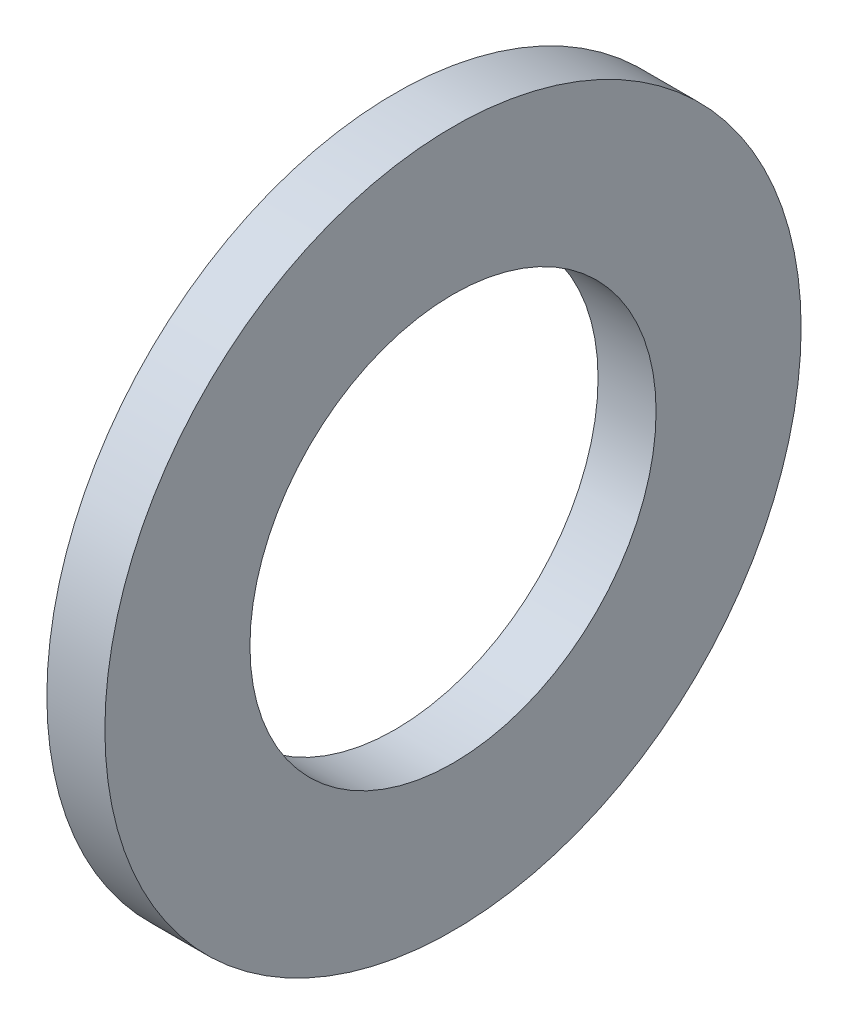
from build123d import *

# Parameters (mm, degrees)
ESQUISSE1_W = 3
ESQUISSE1_H = 7.5


with BuildPart() as part:
    # Esquisse1 → Base-R_volution (revolve)
    with BuildSketch(Plane(origin=(0, 0, 0), x_dir=(1, 0, 0), z_dir=(0, 1, 0)), mode=Mode.PRIVATE) as base_r_volution_sk:
        with Locations((1.5, 14.25)):
            Rectangle(ESQUISSE1_W, ESQUISSE1_H)
    revolve(base_r_volution_sk.sketch.rotate(Axis((0, 0, 0), (1, 0, 0)), 180), axis=Axis((0, 0, 0), (1, 0, 0)))


solid = part.part
